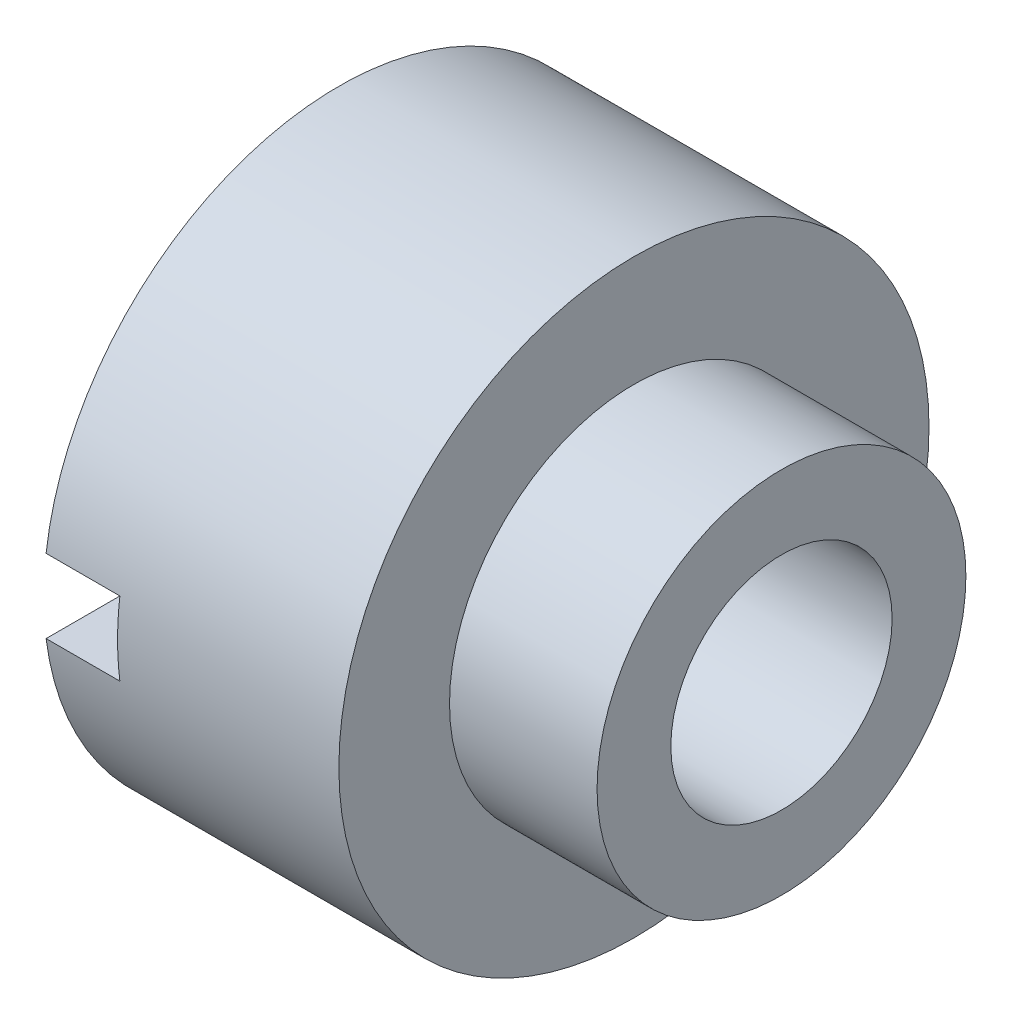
ISO-10303-21;
HEADER;
FILE_DESCRIPTION(('STEP AP214'),'2;1');
FILE_NAME('part.step','',(''),(''),'','','');
FILE_SCHEMA(('AUTOMOTIVE_DESIGN { 1 0 10303 214 1 1 1 1 }'));
ENDSEC;
DATA;
#1=APPLICATION_CONTEXT('core data for automotive mechanical design processes');
#2=APPLICATION_PROTOCOL_DEFINITION('international standard','automotive_design',2000,#1);
#3=PRODUCT_CONTEXT('',#1,'mechanical');
#4=PRODUCT('Part','Part','',(#3));
#5=PRODUCT_RELATED_PRODUCT_CATEGORY('part','',(#4));
#6=PRODUCT_DEFINITION_FORMATION('','',#4);
#7=PRODUCT_DEFINITION_CONTEXT('part definition',#1,'design');
#8=PRODUCT_DEFINITION('design','',#6,#7);
#9=PRODUCT_DEFINITION_SHAPE('','',#8);
#10=(LENGTH_UNIT() NAMED_UNIT(*) SI_UNIT(.MILLI.,.METRE.));
#11=(NAMED_UNIT(*) PLANE_ANGLE_UNIT() SI_UNIT($,.RADIAN.));
#12=(NAMED_UNIT(*) SI_UNIT($,.STERADIAN.) SOLID_ANGLE_UNIT());
#13=UNCERTAINTY_MEASURE_WITH_UNIT(LENGTH_MEASURE(1.E-05),#10,'distance_accuracy_value','');
#14=(GEOMETRIC_REPRESENTATION_CONTEXT(3) GLOBAL_UNCERTAINTY_ASSIGNED_CONTEXT((#13)) GLOBAL_UNIT_ASSIGNED_CONTEXT((#10,
#11,#12)) REPRESENTATION_CONTEXT('',''));
#15=CARTESIAN_POINT('',(0.,0.,0.));
#16=DIRECTION('',(0.,0.,1.));
#17=DIRECTION('',(1.,0.,0.));
#18=AXIS2_PLACEMENT_3D('',#15,#16,#17);
#19=CARTESIAN_POINT('',(0.,0.,0.));
#20=DIRECTION('',(1.,0.,0.));
#21=DIRECTION('',(0.,0.,-1.));
#22=AXIS2_PLACEMENT_3D('',#19,#20,#21);
#23=PLANE('',#22);
#24=CARTESIAN_POINT('',(0.,0.,0.));
#25=DIRECTION('',(-1.,0.,0.));
#26=DIRECTION('',(0.,0.,1.));
#27=AXIS2_PLACEMENT_3D('',#24,#25,#26);
#28=CIRCLE('',#27,8.);
#29=CARTESIAN_POINT('',(0.,0.999999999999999,7.93725393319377));
#30=VERTEX_POINT('',#29);
#31=CARTESIAN_POINT('',(0.,0.999999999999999,-7.93725393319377));
#32=VERTEX_POINT('',#31);
#33=EDGE_CURVE('E464',#30,#32,#28,.T.);
#34=ORIENTED_EDGE('',*,*,#33,.T.);
#35=DIRECTION('',(0.,0.,1.));
#36=VECTOR('',#35,1.);
#37=CARTESIAN_POINT('',(0.,0.999999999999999,-8.));
#38=LINE('',#37,#36);
#39=CARTESIAN_POINT('',(0.,0.999999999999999,-2.82842712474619));
#40=VERTEX_POINT('',#39);
#41=EDGE_CURVE('E442',#32,#40,#38,.T.);
#42=ORIENTED_EDGE('',*,*,#41,.T.);
#43=CARTESIAN_POINT('',(0.,0.,0.));
#44=DIRECTION('',(-1.,0.,0.));
#45=DIRECTION('',(0.,0.,1.));
#46=AXIS2_PLACEMENT_3D('',#43,#44,#45);
#47=CIRCLE('',#46,3.);
#48=CARTESIAN_POINT('',(0.,0.999999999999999,2.82842712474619));
#49=VERTEX_POINT('',#48);
#50=EDGE_CURVE('E457',#49,#40,#47,.T.);
#51=ORIENTED_EDGE('',*,*,#50,.F.);
#52=EDGE_CURVE('E446',#49,#30,#38,.T.);
#53=ORIENTED_EDGE('',*,*,#52,.T.);
#54=EDGE_LOOP('',(#34,#42,#51,#53));
#55=FACE_BOUND('',#54,.T.);
#56=ADVANCED_FACE('F350',(#55),#23,.F.);
#57=CARTESIAN_POINT('',(12.,0.,0.));
#58=DIRECTION('',(-1.,0.,0.));
#59=DIRECTION('',(0.,0.,1.));
#60=AXIS2_PLACEMENT_3D('',#57,#58,#59);
#61=PLANE('',#60);
#62=CARTESIAN_POINT('',(12.,0.,0.));
#63=DIRECTION('',(-1.,0.,0.));
#64=DIRECTION('',(0.,0.,1.));
#65=AXIS2_PLACEMENT_3D('',#62,#63,#64);
#66=CIRCLE('',#65,3.);
#67=CARTESIAN_POINT('',(12.,0.,3.));
#68=VERTEX_POINT('',#67);
#69=EDGE_CURVE('E460',#68,#68,#66,.T.);
#70=ORIENTED_EDGE('',*,*,#69,.T.);
#71=EDGE_LOOP('',(#70));
#72=FACE_BOUND('',#71,.T.);
#73=CARTESIAN_POINT('',(12.,0.,0.));
#74=DIRECTION('',(-1.,0.,0.));
#75=DIRECTION('',(0.,0.,1.));
#76=AXIS2_PLACEMENT_3D('',#73,#74,#75);
#77=CIRCLE('',#76,5.);
#78=CARTESIAN_POINT('',(12.,0.,5.));
#79=VERTEX_POINT('',#78);
#80=EDGE_CURVE('E471',#79,#79,#77,.T.);
#81=ORIENTED_EDGE('',*,*,#80,.F.);
#82=EDGE_LOOP('',(#81));
#83=FACE_BOUND('',#82,.T.);
#84=ADVANCED_FACE('F352',(#72,#83),#61,.F.);
#85=CARTESIAN_POINT('',(-5.48213802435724,0.,0.));
#86=DIRECTION('',(-1.,0.,0.));
#87=DIRECTION('',(0.,0.,1.));
#88=AXIS2_PLACEMENT_3D('',#85,#86,#87);
#89=CYLINDRICAL_SURFACE('',#88,5.);
#90=CARTESIAN_POINT('',(8.,0.,0.));
#91=DIRECTION('',(-1.,0.,0.));
#92=DIRECTION('',(0.,0.,1.));
#93=AXIS2_PLACEMENT_3D('',#90,#91,#92);
#94=CIRCLE('',#93,5.);
#95=CARTESIAN_POINT('',(8.,0.,5.));
#96=VERTEX_POINT('',#95);
#97=EDGE_CURVE('E468',#96,#96,#94,.T.);
#98=ORIENTED_EDGE('',*,*,#97,.F.);
#99=EDGE_LOOP('',(#98));
#100=FACE_BOUND('',#99,.T.);
#101=ORIENTED_EDGE('',*,*,#80,.T.);
#102=EDGE_LOOP('',(#101));
#103=FACE_BOUND('',#102,.T.);
#104=ADVANCED_FACE('F515',(#100,#103),#89,.T.);
#105=CARTESIAN_POINT('',(8.,5.,0.));
#106=DIRECTION('',(-1.,0.,0.));
#107=DIRECTION('',(0.,0.,1.));
#108=AXIS2_PLACEMENT_3D('',#105,#106,#107);
#109=PLANE('',#108);
#110=CARTESIAN_POINT('',(8.,0.,0.));
#111=DIRECTION('',(-1.,0.,0.));
#112=DIRECTION('',(0.,0.,1.));
#113=AXIS2_PLACEMENT_3D('',#110,#111,#112);
#114=CIRCLE('',#113,8.);
#115=CARTESIAN_POINT('',(8.,0.,8.));
#116=VERTEX_POINT('',#115);
#117=EDGE_CURVE('E465',#116,#116,#114,.T.);
#118=ORIENTED_EDGE('',*,*,#117,.F.);
#119=EDGE_LOOP('',(#118));
#120=FACE_BOUND('',#119,.T.);
#121=ORIENTED_EDGE('',*,*,#97,.T.);
#122=EDGE_LOOP('',(#121));
#123=FACE_BOUND('',#122,.T.);
#124=ADVANCED_FACE('F525',(#120,#123),#109,.F.);
#125=CARTESIAN_POINT('',(-5.48213802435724,0.,0.));
#126=DIRECTION('',(-1.,0.,0.));
#127=DIRECTION('',(0.,0.,1.));
#128=AXIS2_PLACEMENT_3D('',#125,#126,#127);
#129=CYLINDRICAL_SURFACE('',#128,8.);
#130=ORIENTED_EDGE('',*,*,#33,.F.);
#131=DIRECTION('',(-1.,0.,0.));
#132=VECTOR('',#131,1.);
#133=CARTESIAN_POINT('',(-5.48213802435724,0.999999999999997,7.93725393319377));
#134=LINE('',#133,#132);
#135=CARTESIAN_POINT('',(2.,1.,7.93725393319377));
#136=VERTEX_POINT('',#135);
#137=EDGE_CURVE('E451',#30,#136,#134,.F.);
#138=ORIENTED_EDGE('',*,*,#137,.T.);
#139=CARTESIAN_POINT('',(2.,0.,0.));
#140=DIRECTION('',(1.,0.,0.));
#141=DIRECTION('',(0.,1.,0.));
#142=AXIS2_PLACEMENT_3D('',#139,#140,#141);
#143=CIRCLE('',#142,8.);
#144=CARTESIAN_POINT('',(2.,-1.,7.93725393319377));
#145=VERTEX_POINT('',#144);
#146=EDGE_CURVE('E427',#136,#145,#143,.T.);
#147=ORIENTED_EDGE('',*,*,#146,.T.);
#148=DIRECTION('',(-1.,0.,0.));
#149=VECTOR('',#148,1.);
#150=CARTESIAN_POINT('',(-5.48213802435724,-0.999999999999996,7.93725393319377));
#151=LINE('',#150,#149);
#152=CARTESIAN_POINT('',(0.,-0.999999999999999,7.93725393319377));
#153=VERTEX_POINT('',#152);
#154=EDGE_CURVE('E428',#145,#153,#151,.T.);
#155=ORIENTED_EDGE('',*,*,#154,.T.);
#156=CARTESIAN_POINT('',(0.,-0.999999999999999,-7.93725393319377));
#157=VERTEX_POINT('',#156);
#158=EDGE_CURVE('E441',#157,#153,#28,.T.);
#159=ORIENTED_EDGE('',*,*,#158,.F.);
#160=DIRECTION('',(-1.,0.,0.));
#161=VECTOR('',#160,1.);
#162=CARTESIAN_POINT('',(-5.48213802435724,-0.999999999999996,-7.93725393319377));
#163=LINE('',#162,#161);
#164=CARTESIAN_POINT('',(2.,-1.,-7.93725393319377));
#165=VERTEX_POINT('',#164);
#166=EDGE_CURVE('E431',#157,#165,#163,.F.);
#167=ORIENTED_EDGE('',*,*,#166,.T.);
#168=CARTESIAN_POINT('',(2.,1.,-7.93725393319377));
#169=VERTEX_POINT('',#168);
#170=EDGE_CURVE('E416',#165,#169,#143,.T.);
#171=ORIENTED_EDGE('',*,*,#170,.T.);
#172=DIRECTION('',(-1.,0.,0.));
#173=VECTOR('',#172,1.);
#174=CARTESIAN_POINT('',(-5.48213802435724,0.999999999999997,-7.93725393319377));
#175=LINE('',#174,#173);
#176=EDGE_CURVE('E454',#169,#32,#175,.T.);
#177=ORIENTED_EDGE('',*,*,#176,.T.);
#178=EDGE_LOOP('',(#130,#138,#147,#155,#159,#167,#171,#177));
#179=FACE_BOUND('',#178,.T.);
#180=ORIENTED_EDGE('',*,*,#117,.T.);
#181=EDGE_LOOP('',(#180));
#182=FACE_BOUND('',#181,.T.);
#183=ADVANCED_FACE('F437',(#179,#182),#129,.T.);
#184=ORIENTED_EDGE('',*,*,#158,.T.);
#185=DIRECTION('',(0.,0.,1.));
#186=VECTOR('',#185,1.);
#187=CARTESIAN_POINT('',(0.,-0.999999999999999,-8.));
#188=LINE('',#187,#186);
#189=CARTESIAN_POINT('',(0.,-0.999999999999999,2.82842712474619));
#190=VERTEX_POINT('',#189);
#191=EDGE_CURVE('E449',#190,#153,#188,.T.);
#192=ORIENTED_EDGE('',*,*,#191,.F.);
#193=CARTESIAN_POINT('',(0.,-1.00000000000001,-2.82842712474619));
#194=VERTEX_POINT('',#193);
#195=EDGE_CURVE('E456',#194,#190,#47,.T.);
#196=ORIENTED_EDGE('',*,*,#195,.F.);
#197=EDGE_CURVE('E373',#157,#194,#188,.T.);
#198=ORIENTED_EDGE('',*,*,#197,.F.);
#199=EDGE_LOOP('',(#184,#192,#196,#198));
#200=FACE_BOUND('',#199,.T.);
#201=ADVANCED_FACE('F496',(#200),#23,.F.);
#202=CARTESIAN_POINT('',(12.,0.,0.));
#203=DIRECTION('',(-1.,0.,0.));
#204=DIRECTION('',(0.,0.,1.));
#205=AXIS2_PLACEMENT_3D('',#202,#203,#204);
#206=CYLINDRICAL_SURFACE('',#205,3.);
#207=ORIENTED_EDGE('',*,*,#69,.F.);
#208=EDGE_LOOP('',(#207));
#209=FACE_BOUND('',#208,.T.);
#210=CARTESIAN_POINT('',(2.,0.,0.));
#211=DIRECTION('',(1.,0.,0.));
#212=DIRECTION('',(0.,1.,0.));
#213=AXIS2_PLACEMENT_3D('',#210,#211,#212);
#214=CIRCLE('',#213,3.);
#215=CARTESIAN_POINT('',(2.,-1.00000000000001,2.82842712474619));
#216=VERTEX_POINT('',#215);
#217=CARTESIAN_POINT('',(2.,1.,2.82842712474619));
#218=VERTEX_POINT('',#217);
#219=EDGE_CURVE('E358',#216,#218,#214,.F.);
#220=ORIENTED_EDGE('',*,*,#219,.T.);
#221=DIRECTION('',(-1.,0.,0.));
#222=VECTOR('',#221,1.);
#223=CARTESIAN_POINT('',(12.,1.,2.82842712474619));
#224=LINE('',#223,#222);
#225=EDGE_CURVE('E11',#218,#49,#224,.T.);
#226=ORIENTED_EDGE('',*,*,#225,.T.);
#227=ORIENTED_EDGE('',*,*,#50,.T.);
#228=DIRECTION('',(-1.,0.,0.));
#229=VECTOR('',#228,1.);
#230=CARTESIAN_POINT('',(12.,1.,-2.82842712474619));
#231=LINE('',#230,#229);
#232=CARTESIAN_POINT('',(2.,1.,-2.82842712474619));
#233=VERTEX_POINT('',#232);
#234=EDGE_CURVE('E477',#40,#233,#231,.F.);
#235=ORIENTED_EDGE('',*,*,#234,.T.);
#236=CARTESIAN_POINT('',(2.,-1.,-2.82842712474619));
#237=VERTEX_POINT('',#236);
#238=EDGE_CURVE('E475',#233,#237,#214,.F.);
#239=ORIENTED_EDGE('',*,*,#238,.T.);
#240=DIRECTION('',(-1.,0.,0.));
#241=VECTOR('',#240,1.);
#242=CARTESIAN_POINT('',(12.,-1.00000000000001,-2.82842712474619));
#243=LINE('',#242,#241);
#244=EDGE_CURVE('E432',#237,#194,#243,.T.);
#245=ORIENTED_EDGE('',*,*,#244,.T.);
#246=ORIENTED_EDGE('',*,*,#195,.T.);
#247=DIRECTION('',(-1.,0.,0.));
#248=VECTOR('',#247,1.);
#249=CARTESIAN_POINT('',(12.,-1.00000000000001,2.82842712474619));
#250=LINE('',#249,#248);
#251=EDGE_CURVE('E479',#190,#216,#250,.F.);
#252=ORIENTED_EDGE('',*,*,#251,.T.);
#253=EDGE_LOOP('',(#220,#226,#227,#235,#239,#245,#246,#252));
#254=FACE_BOUND('',#253,.T.);
#255=ADVANCED_FACE('F484',(#209,#254),#206,.F.);
#256=CARTESIAN_POINT('',(0.,-0.999999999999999,-8.));
#257=DIRECTION('',(0.,-1.,0.));
#258=DIRECTION('',(1.,0.,0.));
#259=AXIS2_PLACEMENT_3D('',#256,#257,#258);
#260=PLANE('',#259);
#261=ORIENTED_EDGE('',*,*,#197,.T.);
#262=ORIENTED_EDGE('',*,*,#244,.F.);
#263=DIRECTION('',(0.,0.,1.));
#264=VECTOR('',#263,1.);
#265=CARTESIAN_POINT('',(2.,-1.,-8.));
#266=LINE('',#265,#264);
#267=EDGE_CURVE('E419',#165,#237,#266,.T.);
#268=ORIENTED_EDGE('',*,*,#267,.F.);
#269=ORIENTED_EDGE('',*,*,#166,.F.);
#270=EDGE_LOOP('',(#261,#262,#268,#269));
#271=FACE_BOUND('',#270,.T.);
#272=ADVANCED_FACE('F430',(#271),#260,.F.);
#273=CARTESIAN_POINT('',(2.,1.,-8.));
#274=DIRECTION('',(1.,0.,0.));
#275=DIRECTION('',(0.,1.,0.));
#276=AXIS2_PLACEMENT_3D('',#273,#274,#275);
#277=PLANE('',#276);
#278=ORIENTED_EDGE('',*,*,#267,.T.);
#279=ORIENTED_EDGE('',*,*,#238,.F.);
#280=DIRECTION('',(0.,0.,1.));
#281=VECTOR('',#280,1.);
#282=CARTESIAN_POINT('',(2.,1.,-8.));
#283=LINE('',#282,#281);
#284=EDGE_CURVE('E422',#169,#233,#283,.T.);
#285=ORIENTED_EDGE('',*,*,#284,.F.);
#286=ORIENTED_EDGE('',*,*,#170,.F.);
#287=EDGE_LOOP('',(#278,#279,#285,#286));
#288=FACE_BOUND('',#287,.T.);
#289=ADVANCED_FACE('F418',(#288),#277,.F.);
#290=CARTESIAN_POINT('',(0.,0.999999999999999,-8.));
#291=DIRECTION('',(0.,1.,0.));
#292=DIRECTION('',(-1.,0.,0.));
#293=AXIS2_PLACEMENT_3D('',#290,#291,#292);
#294=PLANE('',#293);
#295=ORIENTED_EDGE('',*,*,#284,.T.);
#296=ORIENTED_EDGE('',*,*,#234,.F.);
#297=ORIENTED_EDGE('',*,*,#41,.F.);
#298=ORIENTED_EDGE('',*,*,#176,.F.);
#299=EDGE_LOOP('',(#295,#296,#297,#298));
#300=FACE_BOUND('',#299,.T.);
#301=ADVANCED_FACE('F498',(#300),#294,.F.);
#302=ORIENTED_EDGE('',*,*,#52,.F.);
#303=ORIENTED_EDGE('',*,*,#225,.F.);
#304=EDGE_CURVE('E433',#218,#136,#283,.T.);
#305=ORIENTED_EDGE('',*,*,#304,.T.);
#306=ORIENTED_EDGE('',*,*,#137,.F.);
#307=EDGE_LOOP('',(#302,#303,#305,#306));
#308=FACE_BOUND('',#307,.T.);
#309=ADVANCED_FACE('F502',(#308),#294,.F.);
#310=ORIENTED_EDGE('',*,*,#304,.F.);
#311=ORIENTED_EDGE('',*,*,#219,.F.);
#312=EDGE_CURVE('E365',#216,#145,#266,.T.);
#313=ORIENTED_EDGE('',*,*,#312,.T.);
#314=ORIENTED_EDGE('',*,*,#146,.F.);
#315=EDGE_LOOP('',(#310,#311,#313,#314));
#316=FACE_BOUND('',#315,.T.);
#317=ADVANCED_FACE('F488',(#316),#277,.F.);
#318=ORIENTED_EDGE('',*,*,#312,.F.);
#319=ORIENTED_EDGE('',*,*,#251,.F.);
#320=ORIENTED_EDGE('',*,*,#191,.T.);
#321=ORIENTED_EDGE('',*,*,#154,.F.);
#322=EDGE_LOOP('',(#318,#319,#320,#321));
#323=FACE_BOUND('',#322,.T.);
#324=ADVANCED_FACE('F493',(#323),#260,.F.);
#325=CLOSED_SHELL('',(#56,#84,#104,#124,#183,#201,#255,#272,#289,#301,#309,#317,#324));
#326=MANIFOLD_SOLID_BREP('B2',#325);
#327=ADVANCED_BREP_SHAPE_REPRESENTATION('',(#18,#326),#14);
#328=SHAPE_DEFINITION_REPRESENTATION(#9,#327);
ENDSEC;
END-ISO-10303-21;
